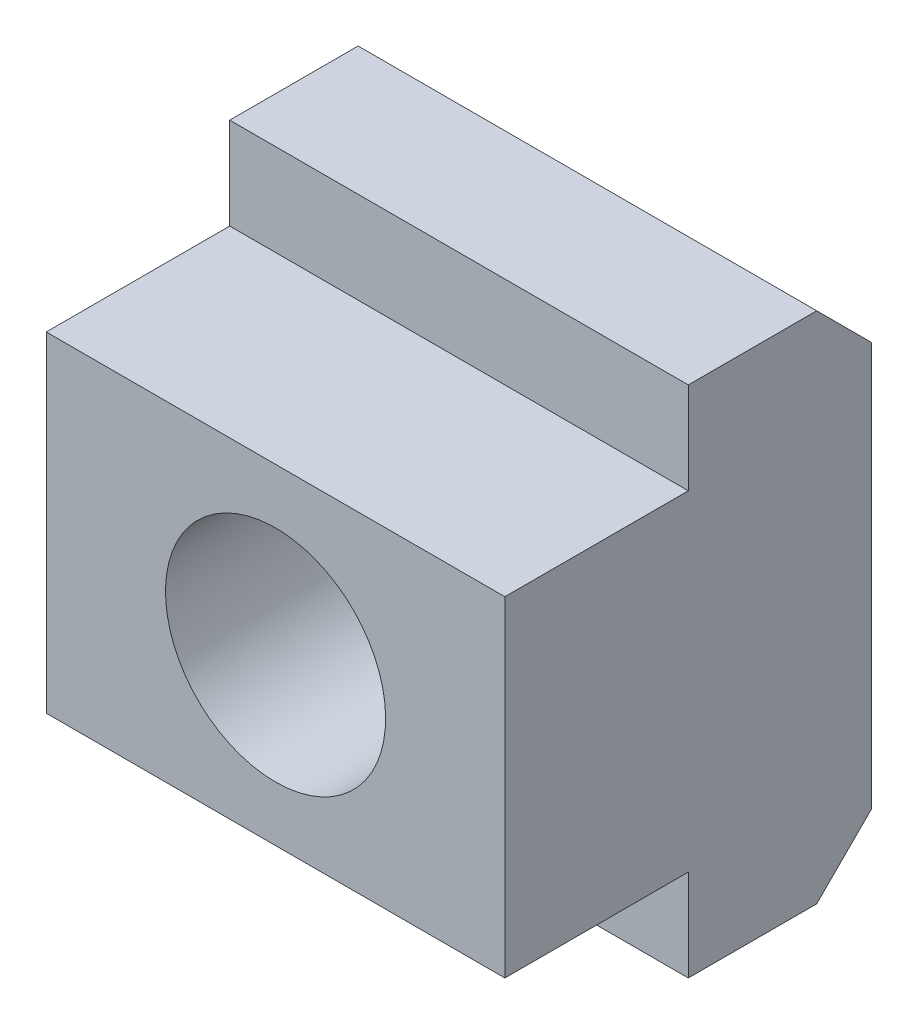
ISO-10303-21;
HEADER;
FILE_DESCRIPTION(('STEP AP214'),'2;1');
FILE_NAME('part.step','',(''),(''),'','','');
FILE_SCHEMA(('AUTOMOTIVE_DESIGN { 1 0 10303 214 1 1 1 1 }'));
ENDSEC;
DATA;
#1=APPLICATION_CONTEXT('core data for automotive mechanical design processes');
#2=APPLICATION_PROTOCOL_DEFINITION('international standard','automotive_design',2000,#1);
#3=PRODUCT_CONTEXT('',#1,'mechanical');
#4=PRODUCT('Part','Part','',(#3));
#5=PRODUCT_RELATED_PRODUCT_CATEGORY('part','',(#4));
#6=PRODUCT_DEFINITION_FORMATION('','',#4);
#7=PRODUCT_DEFINITION_CONTEXT('part definition',#1,'design');
#8=PRODUCT_DEFINITION('design','',#6,#7);
#9=PRODUCT_DEFINITION_SHAPE('','',#8);
#10=(LENGTH_UNIT() NAMED_UNIT(*) SI_UNIT(.MILLI.,.METRE.));
#11=(NAMED_UNIT(*) PLANE_ANGLE_UNIT() SI_UNIT($,.RADIAN.));
#12=(NAMED_UNIT(*) SI_UNIT($,.STERADIAN.) SOLID_ANGLE_UNIT());
#13=UNCERTAINTY_MEASURE_WITH_UNIT(LENGTH_MEASURE(1.E-05),#10,'distance_accuracy_value','');
#14=(GEOMETRIC_REPRESENTATION_CONTEXT(3) GLOBAL_UNCERTAINTY_ASSIGNED_CONTEXT((#13)) GLOBAL_UNIT_ASSIGNED_CONTEXT((#10,
#11,#12)) REPRESENTATION_CONTEXT('',''));
#15=CARTESIAN_POINT('',(0.,0.,0.));
#16=DIRECTION('',(0.,0.,1.));
#17=DIRECTION('',(1.,0.,0.));
#18=AXIS2_PLACEMENT_3D('',#15,#16,#17);
#19=CARTESIAN_POINT('',(12.5,9.,10.));
#20=DIRECTION('',(0.,-1.,0.));
#21=DIRECTION('',(0.,0.,-1.));
#22=AXIS2_PLACEMENT_3D('',#19,#20,#21);
#23=PLANE('',#22);
#24=DIRECTION('',(0.,0.,1.));
#25=VECTOR('',#24,1.);
#26=CARTESIAN_POINT('',(-12.5,9.,10.));
#27=LINE('',#26,#25);
#28=CARTESIAN_POINT('',(-12.5,9.,0.));
#29=VERTEX_POINT('',#28);
#30=CARTESIAN_POINT('',(-12.5,9.,10.));
#31=VERTEX_POINT('',#30);
#32=EDGE_CURVE('E98',#29,#31,#27,.T.);
#33=ORIENTED_EDGE('',*,*,#32,.T.);
#34=DIRECTION('',(-1.,0.,0.));
#35=VECTOR('',#34,1.);
#36=CARTESIAN_POINT('',(12.5,9.,10.));
#37=LINE('',#36,#35);
#38=CARTESIAN_POINT('',(12.5,9.,10.));
#39=VERTEX_POINT('',#38);
#40=EDGE_CURVE('E106',#39,#31,#37,.T.);
#41=ORIENTED_EDGE('',*,*,#40,.F.);
#42=DIRECTION('',(0.,0.,1.));
#43=VECTOR('',#42,1.);
#44=CARTESIAN_POINT('',(12.5,9.,10.));
#45=LINE('',#44,#43);
#46=CARTESIAN_POINT('',(12.5,9.,0.));
#47=VERTEX_POINT('',#46);
#48=EDGE_CURVE('E136',#47,#39,#45,.T.);
#49=ORIENTED_EDGE('',*,*,#48,.F.);
#50=DIRECTION('',(-1.,0.,0.));
#51=VECTOR('',#50,1.);
#52=CARTESIAN_POINT('',(12.5,9.,0.));
#53=LINE('',#52,#51);
#54=EDGE_CURVE('E117',#47,#29,#53,.T.);
#55=ORIENTED_EDGE('',*,*,#54,.T.);
#56=EDGE_LOOP('',(#33,#41,#49,#55));
#57=FACE_BOUND('',#56,.T.);
#58=ADVANCED_FACE('F14',(#57),#23,.F.);
#59=CARTESIAN_POINT('',(12.5,-9.,10.));
#60=DIRECTION('',(0.,0.,-1.));
#61=DIRECTION('',(0.,1.,0.));
#62=AXIS2_PLACEMENT_3D('',#59,#60,#61);
#63=PLANE('',#62);
#64=CARTESIAN_POINT('',(0.,0.,10.));
#65=DIRECTION('',(0.,0.,1.));
#66=DIRECTION('',(0.,-1.,0.));
#67=AXIS2_PLACEMENT_3D('',#64,#65,#66);
#68=CIRCLE('',#67,6.);
#69=CARTESIAN_POINT('',(0.,-6.,10.));
#70=VERTEX_POINT('',#69);
#71=EDGE_CURVE('E121',#70,#70,#68,.T.);
#72=ORIENTED_EDGE('',*,*,#71,.F.);
#73=EDGE_LOOP('',(#72));
#74=FACE_BOUND('',#73,.T.);
#75=DIRECTION('',(0.,-1.,0.));
#76=VECTOR('',#75,1.);
#77=CARTESIAN_POINT('',(-12.5,-9.,10.));
#78=LINE('',#77,#76);
#79=CARTESIAN_POINT('',(-12.5,-9.,10.));
#80=VERTEX_POINT('',#79);
#81=EDGE_CURVE('E92',#31,#80,#78,.T.);
#82=ORIENTED_EDGE('',*,*,#81,.T.);
#83=DIRECTION('',(-1.,0.,0.));
#84=VECTOR('',#83,1.);
#85=CARTESIAN_POINT('',(12.5,-9.,10.));
#86=LINE('',#85,#84);
#87=CARTESIAN_POINT('',(12.5,-9.,10.));
#88=VERTEX_POINT('',#87);
#89=EDGE_CURVE('E113',#88,#80,#86,.T.);
#90=ORIENTED_EDGE('',*,*,#89,.F.);
#91=DIRECTION('',(0.,-1.,0.));
#92=VECTOR('',#91,1.);
#93=CARTESIAN_POINT('',(12.5,-9.,10.));
#94=LINE('',#93,#92);
#95=EDGE_CURVE('E108',#39,#88,#94,.T.);
#96=ORIENTED_EDGE('',*,*,#95,.F.);
#97=ORIENTED_EDGE('',*,*,#40,.T.);
#98=EDGE_LOOP('',(#82,#90,#96,#97));
#99=FACE_BOUND('',#98,.T.);
#100=ADVANCED_FACE('F107',(#74,#99),#63,.F.);
#101=CARTESIAN_POINT('',(12.5,-9.,10.));
#102=DIRECTION('',(0.,1.,0.));
#103=DIRECTION('',(-1.,0.,0.));
#104=AXIS2_PLACEMENT_3D('',#101,#102,#103);
#105=PLANE('',#104);
#106=DIRECTION('',(0.,0.,-1.));
#107=VECTOR('',#106,1.);
#108=CARTESIAN_POINT('',(-12.5,-9.,10.));
#109=LINE('',#108,#107);
#110=CARTESIAN_POINT('',(-12.5,-9.,0.));
#111=VERTEX_POINT('',#110);
#112=EDGE_CURVE('E100',#80,#111,#109,.T.);
#113=ORIENTED_EDGE('',*,*,#112,.T.);
#114=DIRECTION('',(-1.,0.,0.));
#115=VECTOR('',#114,1.);
#116=CARTESIAN_POINT('',(12.5,-9.,0.));
#117=LINE('',#116,#115);
#118=CARTESIAN_POINT('',(12.5,-9.,0.));
#119=VERTEX_POINT('',#118);
#120=EDGE_CURVE('E158',#119,#111,#117,.T.);
#121=ORIENTED_EDGE('',*,*,#120,.F.);
#122=DIRECTION('',(0.,0.,-1.));
#123=VECTOR('',#122,1.);
#124=CARTESIAN_POINT('',(12.5,-9.,10.));
#125=LINE('',#124,#123);
#126=EDGE_CURVE('E139',#88,#119,#125,.T.);
#127=ORIENTED_EDGE('',*,*,#126,.F.);
#128=ORIENTED_EDGE('',*,*,#89,.T.);
#129=EDGE_LOOP('',(#113,#121,#127,#128));
#130=FACE_BOUND('',#129,.T.);
#131=ADVANCED_FACE('F199',(#130),#105,.F.);
#132=CARTESIAN_POINT('',(12.5,-9.,0.));
#133=DIRECTION('',(0.,0.,-1.));
#134=DIRECTION('',(0.,1.,0.));
#135=AXIS2_PLACEMENT_3D('',#132,#133,#134);
#136=PLANE('',#135);
#137=DIRECTION('',(0.,-1.,0.));
#138=VECTOR('',#137,1.);
#139=CARTESIAN_POINT('',(-12.5,-9.,0.));
#140=LINE('',#139,#138);
#141=CARTESIAN_POINT('',(-12.5,-14.,0.));
#142=VERTEX_POINT('',#141);
#143=EDGE_CURVE('E126',#111,#142,#140,.T.);
#144=ORIENTED_EDGE('',*,*,#143,.T.);
#145=DIRECTION('',(-1.,0.,0.));
#146=VECTOR('',#145,1.);
#147=CARTESIAN_POINT('',(12.5,-14.,0.));
#148=LINE('',#147,#146);
#149=CARTESIAN_POINT('',(12.5,-14.,0.));
#150=VERTEX_POINT('',#149);
#151=EDGE_CURVE('E155',#150,#142,#148,.T.);
#152=ORIENTED_EDGE('',*,*,#151,.F.);
#153=DIRECTION('',(0.,-1.,0.));
#154=VECTOR('',#153,1.);
#155=CARTESIAN_POINT('',(12.5,-9.,0.));
#156=LINE('',#155,#154);
#157=EDGE_CURVE('E141',#119,#150,#156,.T.);
#158=ORIENTED_EDGE('',*,*,#157,.F.);
#159=ORIENTED_EDGE('',*,*,#120,.T.);
#160=EDGE_LOOP('',(#144,#152,#158,#159));
#161=FACE_BOUND('',#160,.T.);
#162=ADVANCED_FACE('F195',(#161),#136,.F.);
#163=CARTESIAN_POINT('',(12.5,-14.,0.));
#164=DIRECTION('',(0.,1.,0.));
#165=DIRECTION('',(0.,0.,1.));
#166=AXIS2_PLACEMENT_3D('',#163,#164,#165);
#167=PLANE('',#166);
#168=DIRECTION('',(0.,0.,-1.));
#169=VECTOR('',#168,1.);
#170=CARTESIAN_POINT('',(-12.5,-14.,0.));
#171=LINE('',#170,#169);
#172=CARTESIAN_POINT('',(-12.5,-14.,-7.));
#173=VERTEX_POINT('',#172);
#174=EDGE_CURVE('E128',#142,#173,#171,.T.);
#175=ORIENTED_EDGE('',*,*,#174,.T.);
#176=DIRECTION('',(1.,0.,0.));
#177=VECTOR('',#176,1.);
#178=CARTESIAN_POINT('',(12.5,-14.,-7.));
#179=LINE('',#178,#177);
#180=CARTESIAN_POINT('',(12.5,-14.,-7.));
#181=VERTEX_POINT('',#180);
#182=EDGE_CURVE('E9',#173,#181,#179,.T.);
#183=ORIENTED_EDGE('',*,*,#182,.T.);
#184=DIRECTION('',(0.,0.,-1.));
#185=VECTOR('',#184,1.);
#186=CARTESIAN_POINT('',(12.5,-14.,0.));
#187=LINE('',#186,#185);
#188=EDGE_CURVE('E143',#150,#181,#187,.T.);
#189=ORIENTED_EDGE('',*,*,#188,.F.);
#190=ORIENTED_EDGE('',*,*,#151,.T.);
#191=EDGE_LOOP('',(#175,#183,#189,#190));
#192=FACE_BOUND('',#191,.T.);
#193=ADVANCED_FACE('F191',(#192),#167,.F.);
#194=CARTESIAN_POINT('',(12.5,-14.,-10.));
#195=DIRECTION('',(0.,0.,1.));
#196=DIRECTION('',(0.,-1.,0.));
#197=AXIS2_PLACEMENT_3D('',#194,#195,#196);
#198=PLANE('',#197);
#199=CARTESIAN_POINT('',(0.,0.,-10.));
#200=DIRECTION('',(0.,0.,1.));
#201=DIRECTION('',(0.,-1.,0.));
#202=AXIS2_PLACEMENT_3D('',#199,#200,#201);
#203=CIRCLE('',#202,6.);
#204=CARTESIAN_POINT('',(0.,-5.99999999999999,-10.));
#205=VERTEX_POINT('',#204);
#206=EDGE_CURVE('E118',#205,#205,#203,.T.);
#207=ORIENTED_EDGE('',*,*,#206,.T.);
#208=EDGE_LOOP('',(#207));
#209=FACE_BOUND('',#208,.T.);
#210=DIRECTION('',(0.,1.,0.));
#211=VECTOR('',#210,1.);
#212=CARTESIAN_POINT('',(-12.5,-14.,-10.));
#213=LINE('',#212,#211);
#214=CARTESIAN_POINT('',(-12.5,-11.,-10.));
#215=VERTEX_POINT('',#214);
#216=CARTESIAN_POINT('',(-12.5,11.,-10.));
#217=VERTEX_POINT('',#216);
#218=EDGE_CURVE('E130',#215,#217,#213,.T.);
#219=ORIENTED_EDGE('',*,*,#218,.T.);
#220=DIRECTION('',(1.,0.,0.));
#221=VECTOR('',#220,1.);
#222=CARTESIAN_POINT('',(12.5,11.,-10.));
#223=LINE('',#222,#221);
#224=CARTESIAN_POINT('',(12.5,11.,-10.));
#225=VERTEX_POINT('',#224);
#226=EDGE_CURVE('E34',#217,#225,#223,.T.);
#227=ORIENTED_EDGE('',*,*,#226,.T.);
#228=DIRECTION('',(0.,1.,0.));
#229=VECTOR('',#228,1.);
#230=CARTESIAN_POINT('',(12.5,-14.,-10.));
#231=LINE('',#230,#229);
#232=CARTESIAN_POINT('',(12.5,-11.,-10.));
#233=VERTEX_POINT('',#232);
#234=EDGE_CURVE('E145',#233,#225,#231,.T.);
#235=ORIENTED_EDGE('',*,*,#234,.F.);
#236=DIRECTION('',(-1.,0.,0.));
#237=VECTOR('',#236,1.);
#238=CARTESIAN_POINT('',(12.5,-11.,-10.));
#239=LINE('',#238,#237);
#240=EDGE_CURVE('E168',#233,#215,#239,.T.);
#241=ORIENTED_EDGE('',*,*,#240,.T.);
#242=EDGE_LOOP('',(#219,#227,#235,#241));
#243=FACE_BOUND('',#242,.T.);
#244=ADVANCED_FACE('F185',(#209,#243),#198,.F.);
#245=CARTESIAN_POINT('',(12.5,14.,0.));
#246=DIRECTION('',(0.,-1.,0.));
#247=DIRECTION('',(0.,0.,-1.));
#248=AXIS2_PLACEMENT_3D('',#245,#246,#247);
#249=PLANE('',#248);
#250=DIRECTION('',(0.,0.,1.));
#251=VECTOR('',#250,1.);
#252=CARTESIAN_POINT('',(12.5,14.,0.));
#253=LINE('',#252,#251);
#254=CARTESIAN_POINT('',(12.5,14.,-7.));
#255=VERTEX_POINT('',#254);
#256=CARTESIAN_POINT('',(12.5,14.,0.));
#257=VERTEX_POINT('',#256);
#258=EDGE_CURVE('E147',#255,#257,#253,.T.);
#259=ORIENTED_EDGE('',*,*,#258,.F.);
#260=DIRECTION('',(-1.,0.,0.));
#261=VECTOR('',#260,1.);
#262=CARTESIAN_POINT('',(12.5,14.,-7.));
#263=LINE('',#262,#261);
#264=CARTESIAN_POINT('',(-12.5,14.,-7.));
#265=VERTEX_POINT('',#264);
#266=EDGE_CURVE('E112',#255,#265,#263,.T.);
#267=ORIENTED_EDGE('',*,*,#266,.T.);
#268=DIRECTION('',(0.,0.,1.));
#269=VECTOR('',#268,1.);
#270=CARTESIAN_POINT('',(-12.5,14.,0.));
#271=LINE('',#270,#269);
#272=CARTESIAN_POINT('',(-12.5,14.,0.));
#273=VERTEX_POINT('',#272);
#274=EDGE_CURVE('E132',#265,#273,#271,.T.);
#275=ORIENTED_EDGE('',*,*,#274,.T.);
#276=DIRECTION('',(-1.,0.,0.));
#277=VECTOR('',#276,1.);
#278=CARTESIAN_POINT('',(12.5,14.,0.));
#279=LINE('',#278,#277);
#280=EDGE_CURVE('E152',#257,#273,#279,.T.);
#281=ORIENTED_EDGE('',*,*,#280,.F.);
#282=EDGE_LOOP('',(#259,#267,#275,#281));
#283=FACE_BOUND('',#282,.T.);
#284=ADVANCED_FACE('F181',(#283),#249,.F.);
#285=CARTESIAN_POINT('',(12.5,9.,0.));
#286=DIRECTION('',(0.,0.,-1.));
#287=DIRECTION('',(0.,1.,0.));
#288=AXIS2_PLACEMENT_3D('',#285,#286,#287);
#289=PLANE('',#288);
#290=DIRECTION('',(0.,-1.,0.));
#291=VECTOR('',#290,1.);
#292=CARTESIAN_POINT('',(-12.5,9.,0.));
#293=LINE('',#292,#291);
#294=EDGE_CURVE('E134',#273,#29,#293,.T.);
#295=ORIENTED_EDGE('',*,*,#294,.T.);
#296=ORIENTED_EDGE('',*,*,#54,.F.);
#297=DIRECTION('',(0.,-1.,0.));
#298=VECTOR('',#297,1.);
#299=CARTESIAN_POINT('',(12.5,9.,0.));
#300=LINE('',#299,#298);
#301=EDGE_CURVE('E149',#257,#47,#300,.T.);
#302=ORIENTED_EDGE('',*,*,#301,.F.);
#303=ORIENTED_EDGE('',*,*,#280,.T.);
#304=EDGE_LOOP('',(#295,#296,#302,#303));
#305=FACE_BOUND('',#304,.T.);
#306=ADVANCED_FACE('F201',(#305),#289,.F.);
#307=CARTESIAN_POINT('',(12.5,9.,10.));
#308=DIRECTION('',(1.,0.,0.));
#309=DIRECTION('',(0.,1.,0.));
#310=AXIS2_PLACEMENT_3D('',#307,#308,#309);
#311=PLANE('',#310);
#312=ORIENTED_EDGE('',*,*,#234,.T.);
#313=DIRECTION('',(0.,-0.707106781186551,-0.707106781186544));
#314=VECTOR('',#313,1.);
#315=CARTESIAN_POINT('',(12.5,20.,-1.));
#316=LINE('',#315,#314);
#317=EDGE_CURVE('E21',#225,#255,#316,.F.);
#318=ORIENTED_EDGE('',*,*,#317,.T.);
#319=ORIENTED_EDGE('',*,*,#258,.T.);
#320=ORIENTED_EDGE('',*,*,#301,.T.);
#321=ORIENTED_EDGE('',*,*,#48,.T.);
#322=ORIENTED_EDGE('',*,*,#95,.T.);
#323=ORIENTED_EDGE('',*,*,#126,.T.);
#324=ORIENTED_EDGE('',*,*,#157,.T.);
#325=ORIENTED_EDGE('',*,*,#188,.T.);
#326=DIRECTION('',(0.,-0.707106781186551,0.707106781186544));
#327=VECTOR('',#326,1.);
#328=CARTESIAN_POINT('',(12.5,-10.9999999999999,-10.));
#329=LINE('',#328,#327);
#330=EDGE_CURVE('E172',#181,#233,#329,.F.);
#331=ORIENTED_EDGE('',*,*,#330,.T.);
#332=EDGE_LOOP('',(#312,#318,#319,#320,#321,#322,#323,#324,#325,#331));
#333=FACE_BOUND('',#332,.T.);
#334=ADVANCED_FACE('F176',(#333),#311,.T.);
#335=CARTESIAN_POINT('',(-12.5,9.,10.));
#336=DIRECTION('',(1.,0.,0.));
#337=DIRECTION('',(0.,1.,0.));
#338=AXIS2_PLACEMENT_3D('',#335,#336,#337);
#339=PLANE('',#338);
#340=ORIENTED_EDGE('',*,*,#274,.F.);
#341=DIRECTION('',(0.,0.707106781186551,0.707106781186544));
#342=VECTOR('',#341,1.);
#343=CARTESIAN_POINT('',(-12.5,14.,-7.));
#344=LINE('',#343,#342);
#345=EDGE_CURVE('E166',#265,#217,#344,.F.);
#346=ORIENTED_EDGE('',*,*,#345,.T.);
#347=ORIENTED_EDGE('',*,*,#218,.F.);
#348=DIRECTION('',(0.,0.707106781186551,-0.707106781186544));
#349=VECTOR('',#348,1.);
#350=CARTESIAN_POINT('',(-12.5,-11.,-10.));
#351=LINE('',#350,#349);
#352=EDGE_CURVE('E164',#215,#173,#351,.F.);
#353=ORIENTED_EDGE('',*,*,#352,.T.);
#354=ORIENTED_EDGE('',*,*,#174,.F.);
#355=ORIENTED_EDGE('',*,*,#143,.F.);
#356=ORIENTED_EDGE('',*,*,#112,.F.);
#357=ORIENTED_EDGE('',*,*,#81,.F.);
#358=ORIENTED_EDGE('',*,*,#32,.F.);
#359=ORIENTED_EDGE('',*,*,#294,.F.);
#360=EDGE_LOOP('',(#340,#346,#347,#353,#354,#355,#356,#357,#358,#359));
#361=FACE_BOUND('',#360,.T.);
#362=ADVANCED_FACE('F95',(#361),#339,.F.);
#363=CARTESIAN_POINT('',(12.5,14.,-7.));
#364=DIRECTION('',(0.,-0.707106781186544,0.707106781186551));
#365=DIRECTION('',(0.,-0.707106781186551,-0.707106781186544));
#366=AXIS2_PLACEMENT_3D('',#363,#364,#365);
#367=PLANE('',#366);
#368=ORIENTED_EDGE('',*,*,#317,.F.);
#369=ORIENTED_EDGE('',*,*,#226,.F.);
#370=ORIENTED_EDGE('',*,*,#345,.F.);
#371=ORIENTED_EDGE('',*,*,#266,.F.);
#372=EDGE_LOOP('',(#368,#369,#370,#371));
#373=FACE_BOUND('',#372,.T.);
#374=ADVANCED_FACE('F183',(#373),#367,.F.);
#375=CARTESIAN_POINT('',(12.5,-11.,-10.));
#376=DIRECTION('',(0.,0.707106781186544,0.707106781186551));
#377=DIRECTION('',(0.,-0.707106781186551,0.707106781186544));
#378=AXIS2_PLACEMENT_3D('',#375,#376,#377);
#379=PLANE('',#378);
#380=ORIENTED_EDGE('',*,*,#330,.F.);
#381=ORIENTED_EDGE('',*,*,#182,.F.);
#382=ORIENTED_EDGE('',*,*,#352,.F.);
#383=ORIENTED_EDGE('',*,*,#240,.F.);
#384=EDGE_LOOP('',(#380,#381,#382,#383));
#385=FACE_BOUND('',#384,.T.);
#386=ADVANCED_FACE('F189',(#385),#379,.F.);
#387=CARTESIAN_POINT('',(0.,0.,-10.));
#388=DIRECTION('',(0.,0.,1.));
#389=DIRECTION('',(0.,-1.,0.));
#390=AXIS2_PLACEMENT_3D('',#387,#388,#389);
#391=CYLINDRICAL_SURFACE('',#390,6.);
#392=ORIENTED_EDGE('',*,*,#206,.F.);
#393=EDGE_LOOP('',(#392));
#394=FACE_BOUND('',#393,.T.);
#395=ORIENTED_EDGE('',*,*,#71,.T.);
#396=EDGE_LOOP('',(#395));
#397=FACE_BOUND('',#396,.T.);
#398=ADVANCED_FACE('F236',(#394,#397),#391,.F.);
#399=CLOSED_SHELL('',(#58,#100,#131,#162,#193,#244,#284,#306,#334,#362,#374,#386,#398));
#400=MANIFOLD_SOLID_BREP('B1',#399);
#401=ADVANCED_BREP_SHAPE_REPRESENTATION('',(#18,#400),#14);
#402=SHAPE_DEFINITION_REPRESENTATION(#9,#401);
ENDSEC;
END-ISO-10303-21;
